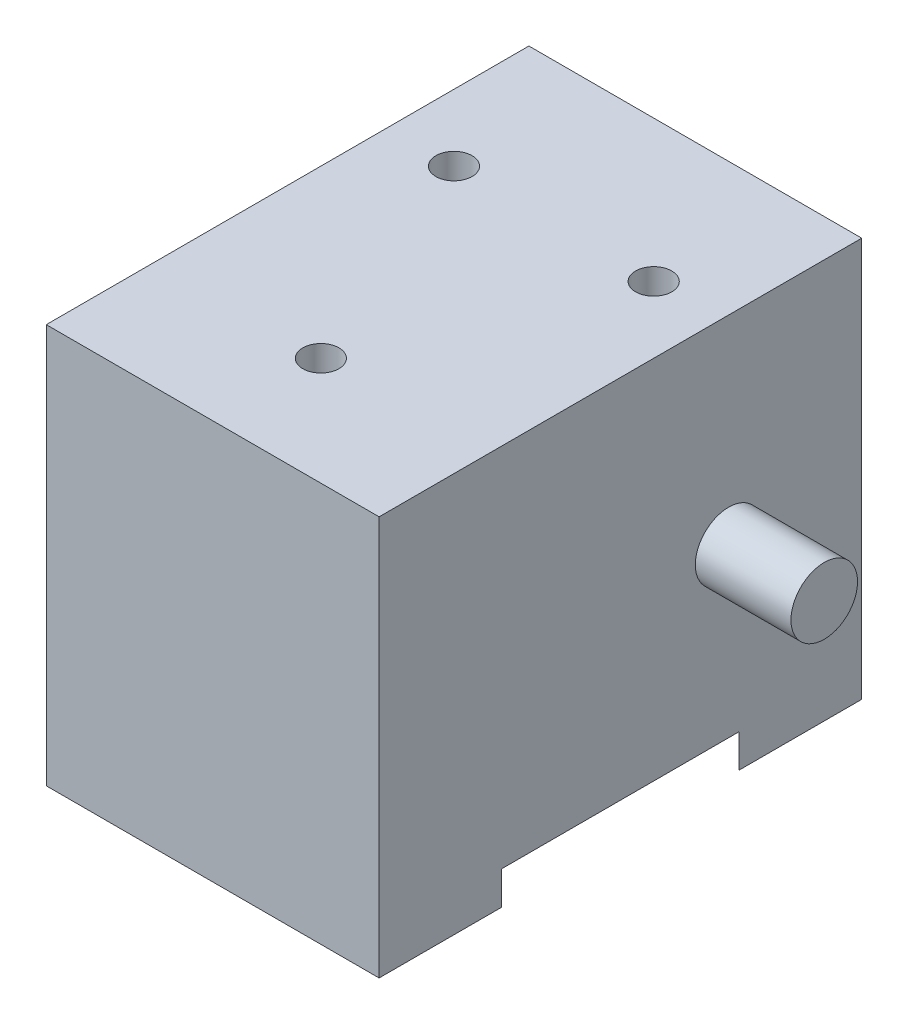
ISO-10303-21;
HEADER;
FILE_DESCRIPTION(('STEP AP214'),'2;1');
FILE_NAME('part.step','',(''),(''),'','','');
FILE_SCHEMA(('AUTOMOTIVE_DESIGN { 1 0 10303 214 1 1 1 1 }'));
ENDSEC;
DATA;
#1=APPLICATION_CONTEXT('core data for automotive mechanical design processes');
#2=APPLICATION_PROTOCOL_DEFINITION('international standard','automotive_design',2000,#1);
#3=PRODUCT_CONTEXT('',#1,'mechanical');
#4=PRODUCT('Part','Part','',(#3));
#5=PRODUCT_RELATED_PRODUCT_CATEGORY('part','',(#4));
#6=PRODUCT_DEFINITION_FORMATION('','',#4);
#7=PRODUCT_DEFINITION_CONTEXT('part definition',#1,'design');
#8=PRODUCT_DEFINITION('design','',#6,#7);
#9=PRODUCT_DEFINITION_SHAPE('','',#8);
#10=(LENGTH_UNIT() NAMED_UNIT(*) SI_UNIT(.MILLI.,.METRE.));
#11=(NAMED_UNIT(*) PLANE_ANGLE_UNIT() SI_UNIT($,.RADIAN.));
#12=(NAMED_UNIT(*) SI_UNIT($,.STERADIAN.) SOLID_ANGLE_UNIT());
#13=UNCERTAINTY_MEASURE_WITH_UNIT(LENGTH_MEASURE(1.E-05),#10,'distance_accuracy_value','');
#14=(GEOMETRIC_REPRESENTATION_CONTEXT(3) GLOBAL_UNCERTAINTY_ASSIGNED_CONTEXT((#13)) GLOBAL_UNIT_ASSIGNED_CONTEXT((#10,
#11,#12)) REPRESENTATION_CONTEXT('',''));
#15=CARTESIAN_POINT('',(0.,0.,0.));
#16=DIRECTION('',(0.,0.,1.));
#17=DIRECTION('',(1.,0.,0.));
#18=AXIS2_PLACEMENT_3D('',#15,#16,#17);
#19=CARTESIAN_POINT('',(15.875,38.1,-23.01875));
#20=DIRECTION('',(-1.,0.,0.));
#21=DIRECTION('',(0.,0.,1.));
#22=AXIS2_PLACEMENT_3D('',#19,#20,#21);
#23=PLANE('',#22);
#24=DIRECTION('',(0.,0.,-1.));
#25=VECTOR('',#24,1.);
#26=CARTESIAN_POINT('',(15.875,0.,-23.01875));
#27=LINE('',#26,#25);
#28=CARTESIAN_POINT('',(15.875,0.,23.01875));
#29=VERTEX_POINT('',#28);
#30=CARTESIAN_POINT('',(15.875,0.,11.3240617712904));
#31=VERTEX_POINT('',#30);
#32=EDGE_CURVE('E172',#29,#31,#27,.T.);
#33=ORIENTED_EDGE('',*,*,#32,.T.);
#34=DIRECTION('',(0.,-1.,0.));
#35=VECTOR('',#34,1.);
#36=CARTESIAN_POINT('',(15.875,3.175,11.3240617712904));
#37=LINE('',#36,#35);
#38=CARTESIAN_POINT('',(15.875,3.175,11.3240617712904));
#39=VERTEX_POINT('',#38);
#40=EDGE_CURVE('E146',#39,#31,#37,.T.);
#41=ORIENTED_EDGE('',*,*,#40,.F.);
#42=DIRECTION('',(0.,0.,1.));
#43=VECTOR('',#42,1.);
#44=CARTESIAN_POINT('',(15.875,3.175,11.3240617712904));
#45=LINE('',#44,#43);
#46=CARTESIAN_POINT('',(15.875,3.175,-11.3240617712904));
#47=VERTEX_POINT('',#46);
#48=EDGE_CURVE('E124',#47,#39,#45,.T.);
#49=ORIENTED_EDGE('',*,*,#48,.F.);
#50=DIRECTION('',(0.,-1.,0.));
#51=VECTOR('',#50,1.);
#52=CARTESIAN_POINT('',(15.875,3.175,-11.3240617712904));
#53=LINE('',#52,#51);
#54=CARTESIAN_POINT('',(15.875,0.,-11.3240617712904));
#55=VERTEX_POINT('',#54);
#56=EDGE_CURVE('E149',#47,#55,#53,.T.);
#57=ORIENTED_EDGE('',*,*,#56,.T.);
#58=CARTESIAN_POINT('',(15.875,0.,-23.01875));
#59=VERTEX_POINT('',#58);
#60=EDGE_CURVE('E164',#55,#59,#27,.T.);
#61=ORIENTED_EDGE('',*,*,#60,.T.);
#62=DIRECTION('',(0.,-1.,0.));
#63=VECTOR('',#62,1.);
#64=CARTESIAN_POINT('',(15.875,38.1,-23.01875));
#65=LINE('',#64,#63);
#66=CARTESIAN_POINT('',(15.875,38.1,-23.01875));
#67=VERTEX_POINT('',#66);
#68=EDGE_CURVE('E186',#67,#59,#65,.T.);
#69=ORIENTED_EDGE('',*,*,#68,.F.);
#70=DIRECTION('',(0.,0.,-1.));
#71=VECTOR('',#70,1.);
#72=CARTESIAN_POINT('',(15.875,38.1,-23.01875));
#73=LINE('',#72,#71);
#74=CARTESIAN_POINT('',(15.875,38.1,23.01875));
#75=VERTEX_POINT('',#74);
#76=EDGE_CURVE('E165',#75,#67,#73,.T.);
#77=ORIENTED_EDGE('',*,*,#76,.F.);
#78=DIRECTION('',(0.,-1.,0.));
#79=VECTOR('',#78,1.);
#80=CARTESIAN_POINT('',(15.875,38.1,23.01875));
#81=LINE('',#80,#79);
#82=EDGE_CURVE('E171',#75,#29,#81,.T.);
#83=ORIENTED_EDGE('',*,*,#82,.T.);
#84=EDGE_LOOP('',(#33,#41,#49,#57,#61,#69,#77,#83));
#85=FACE_BOUND('',#84,.T.);
#86=CARTESIAN_POINT('',(15.875,19.05,-10.31875));
#87=DIRECTION('',(-1.,0.,0.));
#88=DIRECTION('',(0.,0.,1.));
#89=AXIS2_PLACEMENT_3D('',#86,#87,#88);
#90=CIRCLE('',#89,3.175);
#91=CARTESIAN_POINT('',(15.875,19.05,-7.14375000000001));
#92=VERTEX_POINT('',#91);
#93=EDGE_CURVE('E11',#92,#92,#90,.F.);
#94=ORIENTED_EDGE('',*,*,#93,.F.);
#95=EDGE_LOOP('',(#94));
#96=FACE_BOUND('',#95,.T.);
#97=ADVANCED_FACE('F32',(#85,#96),#23,.F.);
#98=CARTESIAN_POINT('',(-15.875,38.1,-23.01875));
#99=DIRECTION('',(1.,0.,0.));
#100=DIRECTION('',(0.,0.,-1.));
#101=AXIS2_PLACEMENT_3D('',#98,#99,#100);
#102=PLANE('',#101);
#103=DIRECTION('',(0.,0.,-1.));
#104=VECTOR('',#103,1.);
#105=CARTESIAN_POINT('',(-15.875,3.175,11.3240617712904));
#106=LINE('',#105,#104);
#107=CARTESIAN_POINT('',(-15.875,3.175,11.3240617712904));
#108=VERTEX_POINT('',#107);
#109=CARTESIAN_POINT('',(-15.875,3.175,-11.3240617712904));
#110=VERTEX_POINT('',#109);
#111=EDGE_CURVE('E130',#108,#110,#106,.T.);
#112=ORIENTED_EDGE('',*,*,#111,.F.);
#113=DIRECTION('',(0.,-1.,0.));
#114=VECTOR('',#113,1.);
#115=CARTESIAN_POINT('',(-15.875,3.175,11.3240617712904));
#116=LINE('',#115,#114);
#117=CARTESIAN_POINT('',(-15.875,0.,11.3240617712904));
#118=VERTEX_POINT('',#117);
#119=EDGE_CURVE('E114',#108,#118,#116,.T.);
#120=ORIENTED_EDGE('',*,*,#119,.T.);
#121=DIRECTION('',(0.,0.,1.));
#122=VECTOR('',#121,1.);
#123=CARTESIAN_POINT('',(-15.875,0.,-23.01875));
#124=LINE('',#123,#122);
#125=CARTESIAN_POINT('',(-15.875,0.,23.01875));
#126=VERTEX_POINT('',#125);
#127=EDGE_CURVE('E177',#118,#126,#124,.T.);
#128=ORIENTED_EDGE('',*,*,#127,.T.);
#129=DIRECTION('',(0.,-1.,0.));
#130=VECTOR('',#129,1.);
#131=CARTESIAN_POINT('',(-15.875,38.1,23.01875));
#132=LINE('',#131,#130);
#133=CARTESIAN_POINT('',(-15.875,38.1,23.01875));
#134=VERTEX_POINT('',#133);
#135=EDGE_CURVE('E182',#134,#126,#132,.T.);
#136=ORIENTED_EDGE('',*,*,#135,.F.);
#137=DIRECTION('',(0.,0.,1.));
#138=VECTOR('',#137,1.);
#139=CARTESIAN_POINT('',(-15.875,38.1,-23.01875));
#140=LINE('',#139,#138);
#141=CARTESIAN_POINT('',(-15.875,38.1,-23.01875));
#142=VERTEX_POINT('',#141);
#143=EDGE_CURVE('E168',#142,#134,#140,.T.);
#144=ORIENTED_EDGE('',*,*,#143,.F.);
#145=DIRECTION('',(0.,-1.,0.));
#146=VECTOR('',#145,1.);
#147=CARTESIAN_POINT('',(-15.875,38.1,-23.01875));
#148=LINE('',#147,#146);
#149=CARTESIAN_POINT('',(-15.875,0.,-23.01875));
#150=VERTEX_POINT('',#149);
#151=EDGE_CURVE('E184',#142,#150,#148,.T.);
#152=ORIENTED_EDGE('',*,*,#151,.T.);
#153=CARTESIAN_POINT('',(-15.875,0.,-11.3240617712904));
#154=VERTEX_POINT('',#153);
#155=EDGE_CURVE('E178',#150,#154,#124,.T.);
#156=ORIENTED_EDGE('',*,*,#155,.T.);
#157=DIRECTION('',(0.,-1.,0.));
#158=VECTOR('',#157,1.);
#159=CARTESIAN_POINT('',(-15.875,3.175,-11.3240617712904));
#160=LINE('',#159,#158);
#161=EDGE_CURVE('E52',#110,#154,#160,.T.);
#162=ORIENTED_EDGE('',*,*,#161,.F.);
#163=EDGE_LOOP('',(#112,#120,#128,#136,#144,#152,#156,#162));
#164=FACE_BOUND('',#163,.T.);
#165=CARTESIAN_POINT('',(-15.875,19.05,-10.31875));
#166=DIRECTION('',(1.,0.,0.));
#167=DIRECTION('',(0.,0.,-1.));
#168=AXIS2_PLACEMENT_3D('',#165,#166,#167);
#169=CIRCLE('',#168,3.175);
#170=CARTESIAN_POINT('',(-15.875,19.05,-13.49375));
#171=VERTEX_POINT('',#170);
#172=EDGE_CURVE('E44',#171,#171,#169,.F.);
#173=ORIENTED_EDGE('',*,*,#172,.F.);
#174=EDGE_LOOP('',(#173));
#175=FACE_BOUND('',#174,.T.);
#176=ADVANCED_FACE('F135',(#164,#175),#102,.F.);
#177=CARTESIAN_POINT('',(9.525,38.1,-9.52373));
#178=DIRECTION('',(0.,1.,0.));
#179=DIRECTION('',(0.,0.,1.));
#180=AXIS2_PLACEMENT_3D('',#177,#178,#179);
#181=CYLINDRICAL_SURFACE('',#180,1.72719999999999);
#182=CARTESIAN_POINT('',(9.525,38.1,-9.52373));
#183=DIRECTION('',(0.,1.,0.));
#184=DIRECTION('',(0.,0.,1.));
#185=AXIS2_PLACEMENT_3D('',#182,#183,#184);
#186=CIRCLE('',#185,1.72719999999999);
#187=CARTESIAN_POINT('',(9.525,38.1,-7.79653000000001));
#188=VERTEX_POINT('',#187);
#189=EDGE_CURVE('E155',#188,#188,#186,.T.);
#190=ORIENTED_EDGE('',*,*,#189,.T.);
#191=EDGE_LOOP('',(#190));
#192=FACE_BOUND('',#191,.T.);
#193=CARTESIAN_POINT('',(9.525,20.9784790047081,-7.79653000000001));
#194=CARTESIAN_POINT('',(9.58924090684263,20.9784875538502,-7.7965342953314));
#195=CARTESIAN_POINT('',(9.65358439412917,20.9832461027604,-7.80015341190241));
#196=CARTESIAN_POINT('',(9.78028689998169,21.0015344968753,-7.81430173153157));
#197=CARTESIAN_POINT('',(9.8426397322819,21.015089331,-7.82485062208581));
#198=CARTESIAN_POINT('',(9.98220083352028,21.0542863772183,-7.85617948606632));
#199=CARTESIAN_POINT('',(10.0582428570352,21.0823368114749,-7.87908130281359));
#200=CARTESIAN_POINT('',(10.2037331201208,21.1460194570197,-7.93356900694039));
#201=CARTESIAN_POINT('',(10.2731650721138,21.1816697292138,-7.9651756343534));
#202=CARTESIAN_POINT('',(10.4355457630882,21.2744156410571,-8.0519833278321));
#203=CARTESIAN_POINT('',(10.5248763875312,21.3339038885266,-8.1113837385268));
#204=CARTESIAN_POINT('',(10.6902472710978,21.4553827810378,-8.2444004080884));
#205=CARTESIAN_POINT('',(10.7662716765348,21.5173763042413,-8.31803340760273));
#206=CARTESIAN_POINT('',(10.9057491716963,21.6407325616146,-8.48045121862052));
#207=CARTESIAN_POINT('',(10.9689163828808,21.7020570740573,-8.5695127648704));
#208=CARTESIAN_POINT('',(11.0784640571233,21.8187382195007,-8.76080133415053));
#209=CARTESIAN_POINT('',(11.1248786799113,21.8741068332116,-8.86300098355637));
#210=CARTESIAN_POINT('',(11.1891367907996,21.9632854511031,-9.05317385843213));
#211=CARTESIAN_POINT('',(11.2111398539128,21.999098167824,-9.13880270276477));
#212=CARTESIAN_POINT('',(11.2418676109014,22.0636193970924,-9.31500792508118));
#213=CARTESIAN_POINT('',(11.2506010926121,22.092332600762,-9.40558098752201));
#214=CARTESIAN_POINT('',(11.2534046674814,22.1416369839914,-9.58968963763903));
#215=CARTESIAN_POINT('',(11.2473987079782,22.1621853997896,-9.68323812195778));
#216=CARTESIAN_POINT('',(11.2198374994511,22.1944864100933,-9.86956935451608));
#217=CARTESIAN_POINT('',(11.198285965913,22.2062411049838,-9.96235228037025));
#218=CARTESIAN_POINT('',(11.1424565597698,22.2208170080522,-10.1358021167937));
#219=CARTESIAN_POINT('',(11.1094409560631,22.2243230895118,-10.2168227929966));
#220=CARTESIAN_POINT('',(11.0315311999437,22.2254976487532,-10.3729635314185));
#221=CARTESIAN_POINT('',(10.986636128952,22.2231656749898,-10.4480831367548));
#222=CARTESIAN_POINT('',(10.8852238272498,22.2140688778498,-10.5918599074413));
#223=CARTESIAN_POINT('',(10.8285004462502,22.207219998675,-10.6603657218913));
#224=CARTESIAN_POINT('',(10.7054180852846,22.1908307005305,-10.7877250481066));
#225=CARTESIAN_POINT('',(10.639055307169,22.1812892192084,-10.8465747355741));
#226=CARTESIAN_POINT('',(10.4927406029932,22.1606310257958,-10.9575229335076));
#227=CARTESIAN_POINT('',(10.4121351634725,22.1494495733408,-11.0087497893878));
#228=CARTESIAN_POINT('',(10.2434472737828,22.128402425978,-11.0973021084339));
#229=CARTESIAN_POINT('',(10.1553640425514,22.1185368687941,-11.1346261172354));
#230=CARTESIAN_POINT('',(9.97194280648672,22.1018696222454,-11.1949511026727));
#231=CARTESIAN_POINT('',(9.87648780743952,22.0951401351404,-11.2176188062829));
#232=CARTESIAN_POINT('',(9.68292050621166,22.0864761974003,-11.2464744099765));
#233=CARTESIAN_POINT('',(9.58480918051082,22.0845400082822,-11.2526682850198));
#234=CARTESIAN_POINT('',(9.39302192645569,22.0858359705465,-11.2484400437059));
#235=CARTESIAN_POINT('',(9.29932898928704,22.0888595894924,-11.238688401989));
#236=CARTESIAN_POINT('',(9.11498771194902,22.0990917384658,-11.204178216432));
#237=CARTESIAN_POINT('',(9.02433979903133,22.1063008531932,-11.1794175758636));
#238=CARTESIAN_POINT('',(8.84834020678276,22.1235482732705,-11.1156256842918));
#239=CARTESIAN_POINT('',(8.76299812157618,22.1335915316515,-11.0765694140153));
#240=CARTESIAN_POINT('',(8.59981371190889,22.1546113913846,-10.9852355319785));
#241=CARTESIAN_POINT('',(8.52197382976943,22.1655882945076,-10.9329536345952));
#242=CARTESIAN_POINT('',(8.3725985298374,22.1867486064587,-10.8139555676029));
#243=CARTESIAN_POINT('',(8.30146121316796,22.1968798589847,-10.7467285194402));
#244=CARTESIAN_POINT('',(8.17135867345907,22.2132818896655,-10.6009536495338));
#245=CARTESIAN_POINT('',(8.11239063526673,22.2195535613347,-10.5224084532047));
#246=CARTESIAN_POINT('',(8.00985958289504,22.2257837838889,-10.3584001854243));
#247=CARTESIAN_POINT('',(7.96593707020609,22.2259016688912,-10.2731690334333));
#248=CARTESIAN_POINT('',(7.89289662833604,22.2184650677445,-10.0969160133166));
#249=CARTESIAN_POINT('',(7.86376874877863,22.2109157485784,-10.0058980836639));
#250=CARTESIAN_POINT('',(7.82265165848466,22.1880975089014,-9.82849453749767));
#251=CARTESIAN_POINT('',(7.8095190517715,22.173465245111,-9.74228923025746));
#252=CARTESIAN_POINT('',(7.79628343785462,22.1368131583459,-9.57046847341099));
#253=CARTESIAN_POINT('',(7.79618098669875,22.1147930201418,-9.48485304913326));
#254=CARTESIAN_POINT('',(7.80817582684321,22.0640354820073,-9.31679727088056));
#255=CARTESIAN_POINT('',(7.82024348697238,22.0353145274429,-9.23434971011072));
#256=CARTESIAN_POINT('',(7.85532244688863,21.9721570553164,-9.07414202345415));
#257=CARTESIAN_POINT('',(7.87833683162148,21.9377189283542,-8.99638322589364));
#258=CARTESIAN_POINT('',(7.93733071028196,21.8599963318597,-8.83779043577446));
#259=CARTESIAN_POINT('',(7.97452593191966,21.81614693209,-8.75768913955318));
#260=CARTESIAN_POINT('',(8.05942877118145,21.7246435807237,-8.6056241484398));
#261=CARTESIAN_POINT('',(8.10714624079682,21.6769860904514,-8.53366817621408));
#262=CARTESIAN_POINT('',(8.22178997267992,21.5706274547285,-8.3856579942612));
#263=CARTESIAN_POINT('',(8.29064090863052,21.5115342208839,-8.31137556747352));
#264=CARTESIAN_POINT('',(8.44064139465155,21.3942003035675,-8.17553222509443));
#265=CARTESIAN_POINT('',(8.52179307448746,21.3359597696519,-8.11397351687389));
#266=CARTESIAN_POINT('',(8.67411316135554,21.2394762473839,-8.01871134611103));
#267=CARTESIAN_POINT('',(8.74252026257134,21.1999303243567,-7.98191109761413));
#268=CARTESIAN_POINT('',(8.88646302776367,21.1271168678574,-7.91696335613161));
#269=CARTESIAN_POINT('',(8.96198599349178,21.093838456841,-7.88880081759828));
#270=CARTESIAN_POINT('',(9.10030987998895,21.0446965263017,-7.84841254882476));
#271=CARTESIAN_POINT('',(9.16164235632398,21.0265616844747,-7.83396833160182));
#272=CARTESIAN_POINT('',(9.28724049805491,20.9983674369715,-7.81179536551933));
#273=CARTESIAN_POINT('',(9.35149572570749,20.9882813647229,-7.80404443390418));
#274=CARTESIAN_POINT('',(9.43434355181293,20.9814640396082,-7.79881492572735));
#275=CARTESIAN_POINT('',(9.45244263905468,20.980347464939,-7.79795949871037));
#276=CARTESIAN_POINT('',(9.48869174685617,20.9788536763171,-7.79681638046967));
#277=CARTESIAN_POINT('',(9.50684177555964,20.9784765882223,-7.79652878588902));
#278=CARTESIAN_POINT('',(9.525,20.9784790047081,-7.79653000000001));
#279=B_SPLINE_CURVE_WITH_KNOTS('',3,(#193,#194,#195,#196,#197,#198,#199,#200,#201,#202,#203,
#204,#205,#206,#207,#208,#209,#210,#211,#212,#213,#214,#215,#216,#217,#218,#219,#220,#221,#222,
#223,#224,#225,#226,#227,#228,#229,#230,#231,#232,#233,#234,#235,#236,#237,#238,#239,#240,#241,
#242,#243,#244,#245,#246,#247,#248,#249,#250,#251,#252,#253,#254,#255,#256,#257,#258,#259,#260,
#261,#262,#263,#264,#265,#266,#267,#268,#269,#270,#271,#272,#273,#274,#275,#276,#277,#278),
.UNSPECIFIED.,.T.,.F.,(4,2,2,2,2,2,2,2,2,2,2,2,2,2,2,2,2,2,2,2,2,2,2,2,2,2,2,2,2,2,2,2,2,2,2,2,
2,2,2,2,2,2,4),(0.,0.192644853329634,0.385839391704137,0.637087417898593,0.888939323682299,
1.2550280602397,1.62155004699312,1.99549725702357,2.36867759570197,2.65368097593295,
2.93849552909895,3.2247827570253,3.51100158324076,3.77245923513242,4.03393711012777,
4.3004236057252,4.56701538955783,4.8541834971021,5.14138163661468,5.43489996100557,
5.72831181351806,6.00970050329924,6.29112851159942,6.57305143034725,6.85506582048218,
7.14883690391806,7.44253995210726,7.72863455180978,8.01453647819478,8.27850484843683,
8.54248448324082,8.80582294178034,9.06923565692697,9.3639518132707,9.65894509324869,
10.0093847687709,10.3598851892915,10.6206723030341,10.8810025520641,11.0769972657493,
11.2723398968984,11.3267832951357,11.3812359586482),.UNSPECIFIED.);
#280=CARTESIAN_POINT('',(9.525,20.9784790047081,-7.79653000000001));
#281=VERTEX_POINT('',#280);
#282=EDGE_CURVE('E189',#281,#281,#279,.T.);
#283=ORIENTED_EDGE('',*,*,#282,.F.);
#284=EDGE_LOOP('',(#283));
#285=FACE_BOUND('',#284,.T.);
#286=ADVANCED_FACE('F204',(#192,#285),#181,.F.);
#287=CARTESIAN_POINT('',(-9.525,38.1,-9.52373));
#288=DIRECTION('',(0.,1.,0.));
#289=DIRECTION('',(0.,0.,1.));
#290=AXIS2_PLACEMENT_3D('',#287,#288,#289);
#291=CYLINDRICAL_SURFACE('',#290,1.72719999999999);
#292=CARTESIAN_POINT('',(-9.525,38.1,-9.52373));
#293=DIRECTION('',(0.,1.,0.));
#294=DIRECTION('',(0.,0.,1.));
#295=AXIS2_PLACEMENT_3D('',#292,#293,#294);
#296=CIRCLE('',#295,1.72719999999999);
#297=CARTESIAN_POINT('',(-9.525,38.1,-7.79653000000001));
#298=VERTEX_POINT('',#297);
#299=EDGE_CURVE('E148',#298,#298,#296,.T.);
#300=ORIENTED_EDGE('',*,*,#299,.T.);
#301=EDGE_LOOP('',(#300));
#302=FACE_BOUND('',#301,.T.);
#303=CARTESIAN_POINT('',(-9.525,20.9784790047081,-7.79653000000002));
#304=CARTESIAN_POINT('',(-9.46075909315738,20.9784875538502,-7.7965342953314));
#305=CARTESIAN_POINT('',(-9.39641560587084,20.9832461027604,-7.80015341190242));
#306=CARTESIAN_POINT('',(-9.26971310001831,21.0015344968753,-7.81430173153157));
#307=CARTESIAN_POINT('',(-9.2073602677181,21.015089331,-7.82485062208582));
#308=CARTESIAN_POINT('',(-9.06779916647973,21.0542863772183,-7.85617948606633));
#309=CARTESIAN_POINT('',(-8.99175714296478,21.0823368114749,-7.87908130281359));
#310=CARTESIAN_POINT('',(-8.84626687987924,21.1460194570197,-7.93356900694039));
#311=CARTESIAN_POINT('',(-8.77683492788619,21.1816697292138,-7.9651756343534));
#312=CARTESIAN_POINT('',(-8.61445423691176,21.2744156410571,-8.0519833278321));
#313=CARTESIAN_POINT('',(-8.52512361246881,21.3339038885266,-8.1113837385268));
#314=CARTESIAN_POINT('',(-8.35975272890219,21.4553827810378,-8.2444004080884));
#315=CARTESIAN_POINT('',(-8.28372832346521,21.5173763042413,-8.31803340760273));
#316=CARTESIAN_POINT('',(-8.14425082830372,21.6407325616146,-8.48045121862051));
#317=CARTESIAN_POINT('',(-8.08108361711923,21.7020570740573,-8.5695127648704));
#318=CARTESIAN_POINT('',(-7.97153594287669,21.8187382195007,-8.76080133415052));
#319=CARTESIAN_POINT('',(-7.9251213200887,21.8741068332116,-8.86300098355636));
#320=CARTESIAN_POINT('',(-7.86086320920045,21.9632854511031,-9.05317385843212));
#321=CARTESIAN_POINT('',(-7.83886014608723,21.999098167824,-9.13880270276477));
#322=CARTESIAN_POINT('',(-7.80813238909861,22.0636193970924,-9.31500792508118));
#323=CARTESIAN_POINT('',(-7.79939890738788,22.092332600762,-9.40558098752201));
#324=CARTESIAN_POINT('',(-7.79659533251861,22.1416369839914,-9.58968963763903));
#325=CARTESIAN_POINT('',(-7.8026012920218,22.1621853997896,-9.68323812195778));
#326=CARTESIAN_POINT('',(-7.83016250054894,22.1944864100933,-9.86956935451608));
#327=CARTESIAN_POINT('',(-7.85171403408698,22.2062411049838,-9.96235228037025));
#328=CARTESIAN_POINT('',(-7.90754344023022,22.2208170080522,-10.1358021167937));
#329=CARTESIAN_POINT('',(-7.94055904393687,22.2243230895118,-10.2168227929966));
#330=CARTESIAN_POINT('',(-8.01846880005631,22.2254976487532,-10.3729635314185));
#331=CARTESIAN_POINT('',(-8.06336387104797,22.2231656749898,-10.4480831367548));
#332=CARTESIAN_POINT('',(-8.16477617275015,22.2140688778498,-10.5918599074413));
#333=CARTESIAN_POINT('',(-8.22149955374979,22.207219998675,-10.6603657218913));
#334=CARTESIAN_POINT('',(-8.34458191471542,22.1908307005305,-10.7877250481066));
#335=CARTESIAN_POINT('',(-8.41094469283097,22.1812892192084,-10.8465747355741));
#336=CARTESIAN_POINT('',(-8.55725939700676,22.1606310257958,-10.9575229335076));
#337=CARTESIAN_POINT('',(-8.63786483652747,22.1494495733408,-11.0087497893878));
#338=CARTESIAN_POINT('',(-8.80655272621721,22.128402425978,-11.0973021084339));
#339=CARTESIAN_POINT('',(-8.89463595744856,22.1185368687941,-11.1346261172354));
#340=CARTESIAN_POINT('',(-9.07805719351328,22.1018696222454,-11.1949511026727));
#341=CARTESIAN_POINT('',(-9.17351219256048,22.0951401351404,-11.2176188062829));
#342=CARTESIAN_POINT('',(-9.36707949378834,22.0864761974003,-11.2464744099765));
#343=CARTESIAN_POINT('',(-9.46519081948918,22.0845400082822,-11.2526682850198));
#344=CARTESIAN_POINT('',(-9.65697807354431,22.0858359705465,-11.2484400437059));
#345=CARTESIAN_POINT('',(-9.75067101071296,22.0888595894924,-11.238688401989));
#346=CARTESIAN_POINT('',(-9.93501228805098,22.0990917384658,-11.204178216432));
#347=CARTESIAN_POINT('',(-10.0256602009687,22.1063008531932,-11.1794175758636));
#348=CARTESIAN_POINT('',(-10.2016597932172,22.1235482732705,-11.1156256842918));
#349=CARTESIAN_POINT('',(-10.2870018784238,22.1335915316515,-11.0765694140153));
#350=CARTESIAN_POINT('',(-10.4501862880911,22.1546113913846,-10.9852355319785));
#351=CARTESIAN_POINT('',(-10.5280261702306,22.1655882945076,-10.9329536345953));
#352=CARTESIAN_POINT('',(-10.6774014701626,22.1867486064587,-10.8139555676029));
#353=CARTESIAN_POINT('',(-10.748538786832,22.1968798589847,-10.7467285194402));
#354=CARTESIAN_POINT('',(-10.8786413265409,22.2132818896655,-10.6009536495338));
#355=CARTESIAN_POINT('',(-10.9376093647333,22.2195535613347,-10.5224084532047));
#356=CARTESIAN_POINT('',(-11.040140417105,22.2257837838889,-10.3584001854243));
#357=CARTESIAN_POINT('',(-11.0840629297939,22.2259016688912,-10.2731690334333));
#358=CARTESIAN_POINT('',(-11.157103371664,22.2184650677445,-10.0969160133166));
#359=CARTESIAN_POINT('',(-11.1862312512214,22.2109157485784,-10.0058980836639));
#360=CARTESIAN_POINT('',(-11.2273483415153,22.1880975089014,-9.82849453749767));
#361=CARTESIAN_POINT('',(-11.2404809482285,22.173465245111,-9.74228923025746));
#362=CARTESIAN_POINT('',(-11.2537165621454,22.1368131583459,-9.57046847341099));
#363=CARTESIAN_POINT('',(-11.2538190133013,22.1147930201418,-9.48485304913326));
#364=CARTESIAN_POINT('',(-11.2418241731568,22.0640354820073,-9.31679727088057));
#365=CARTESIAN_POINT('',(-11.2297565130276,22.0353145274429,-9.23434971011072));
#366=CARTESIAN_POINT('',(-11.1946775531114,21.9721570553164,-9.07414202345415));
#367=CARTESIAN_POINT('',(-11.1716631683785,21.9377189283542,-8.99638322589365));
#368=CARTESIAN_POINT('',(-11.112669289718,21.8599963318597,-8.83779043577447));
#369=CARTESIAN_POINT('',(-11.0754740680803,21.81614693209,-8.75768913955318));
#370=CARTESIAN_POINT('',(-10.9905712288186,21.7246435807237,-8.6056241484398));
#371=CARTESIAN_POINT('',(-10.9428537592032,21.6769860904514,-8.53366817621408));
#372=CARTESIAN_POINT('',(-10.8282100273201,21.5706274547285,-8.3856579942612));
#373=CARTESIAN_POINT('',(-10.7593590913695,21.5115342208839,-8.31137556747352));
#374=CARTESIAN_POINT('',(-10.6093586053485,21.3942003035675,-8.17553222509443));
#375=CARTESIAN_POINT('',(-10.5282069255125,21.3359597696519,-8.11397351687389));
#376=CARTESIAN_POINT('',(-10.3758868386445,21.239476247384,-8.01871134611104));
#377=CARTESIAN_POINT('',(-10.3074797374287,21.1999303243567,-7.98191109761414));
#378=CARTESIAN_POINT('',(-10.1635369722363,21.1271168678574,-7.91696335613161));
#379=CARTESIAN_POINT('',(-10.0880140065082,21.093838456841,-7.88880081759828));
#380=CARTESIAN_POINT('',(-9.94969012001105,21.0446965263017,-7.84841254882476));
#381=CARTESIAN_POINT('',(-9.88835764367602,21.0265616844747,-7.83396833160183));
#382=CARTESIAN_POINT('',(-9.7627595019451,20.9983674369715,-7.81179536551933));
#383=CARTESIAN_POINT('',(-9.69850427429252,20.9882813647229,-7.80404443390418));
#384=CARTESIAN_POINT('',(-9.61565644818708,20.9814640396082,-7.79881492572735));
#385=CARTESIAN_POINT('',(-9.59755736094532,20.980347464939,-7.79795949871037));
#386=CARTESIAN_POINT('',(-9.56130825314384,20.9788536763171,-7.79681638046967));
#387=CARTESIAN_POINT('',(-9.54315822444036,20.9784765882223,-7.79652878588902));
#388=CARTESIAN_POINT('',(-9.525,20.9784790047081,-7.79653000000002));
#389=B_SPLINE_CURVE_WITH_KNOTS('',3,(#303,#304,#305,#306,#307,#308,#309,#310,#311,#312,#313,
#314,#315,#316,#317,#318,#319,#320,#321,#322,#323,#324,#325,#326,#327,#328,#329,#330,#331,#332,
#333,#334,#335,#336,#337,#338,#339,#340,#341,#342,#343,#344,#345,#346,#347,#348,#349,#350,#351,
#352,#353,#354,#355,#356,#357,#358,#359,#360,#361,#362,#363,#364,#365,#366,#367,#368,#369,#370,
#371,#372,#373,#374,#375,#376,#377,#378,#379,#380,#381,#382,#383,#384,#385,#386,#387,#388),
.UNSPECIFIED.,.T.,.F.,(4,2,2,2,2,2,2,2,2,2,2,2,2,2,2,2,2,2,2,2,2,2,2,2,2,2,2,2,2,2,2,2,2,2,2,2,
2,2,2,2,2,2,4),(0.,0.192644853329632,0.385839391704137,0.637087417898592,0.888939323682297,
1.25502806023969,1.62155004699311,1.99549725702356,2.36867759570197,2.65368097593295,
2.93849552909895,3.2247827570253,3.51100158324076,3.77245923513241,4.03393711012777,
4.3004236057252,4.56701538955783,4.8541834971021,5.14138163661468,5.43489996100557,
5.72831181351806,6.00970050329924,6.29112851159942,6.57305143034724,6.85506582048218,
7.14883690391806,7.44253995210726,7.72863455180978,8.01453647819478,8.27850484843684,
8.54248448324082,8.80582294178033,9.06923565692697,9.3639518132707,9.65894509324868,
10.0093847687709,10.3598851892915,10.6206723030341,10.8810025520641,11.0769972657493,
11.2723398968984,11.3267832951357,11.3812359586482),.UNSPECIFIED.);
#390=CARTESIAN_POINT('',(-9.525,20.9784790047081,-7.79653000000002));
#391=VERTEX_POINT('',#390);
#392=EDGE_CURVE('E35',#391,#391,#389,.T.);
#393=ORIENTED_EDGE('',*,*,#392,.F.);
#394=EDGE_LOOP('',(#393));
#395=FACE_BOUND('',#394,.T.);
#396=ADVANCED_FACE('F226',(#302,#395),#291,.F.);
#397=CARTESIAN_POINT('',(15.875,0.,23.01875));
#398=DIRECTION('',(0.,1.,0.));
#399=DIRECTION('',(0.,0.,1.));
#400=AXIS2_PLACEMENT_3D('',#397,#398,#399);
#401=PLANE('',#400);
#402=ORIENTED_EDGE('',*,*,#127,.F.);
#403=CARTESIAN_POINT('',(0.,0.,0.));
#404=DIRECTION('',(0.,-1.,0.));
#405=DIRECTION('',(0.,0.,-1.));
#406=AXIS2_PLACEMENT_3D('',#403,#404,#405);
#407=CIRCLE('',#406,19.5);
#408=EDGE_CURVE('E120',#31,#118,#407,.T.);
#409=ORIENTED_EDGE('',*,*,#408,.F.);
#410=ORIENTED_EDGE('',*,*,#32,.F.);
#411=DIRECTION('',(1.,0.,0.));
#412=VECTOR('',#411,1.);
#413=CARTESIAN_POINT('',(-15.875,0.,23.01875));
#414=LINE('',#413,#412);
#415=EDGE_CURVE('E82',#126,#29,#414,.T.);
#416=ORIENTED_EDGE('',*,*,#415,.F.);
#417=EDGE_LOOP('',(#402,#409,#410,#416));
#418=FACE_BOUND('',#417,.T.);
#419=ADVANCED_FACE('F229',(#418),#401,.F.);
#420=CARTESIAN_POINT('',(-15.875,38.1,-23.01875));
#421=DIRECTION('',(0.,0.,1.));
#422=DIRECTION('',(1.,0.,0.));
#423=AXIS2_PLACEMENT_3D('',#420,#421,#422);
#424=PLANE('',#423);
#425=DIRECTION('',(-1.,0.,0.));
#426=VECTOR('',#425,1.);
#427=CARTESIAN_POINT('',(-15.875,0.,-23.01875));
#428=LINE('',#427,#426);
#429=EDGE_CURVE('E175',#59,#150,#428,.T.);
#430=ORIENTED_EDGE('',*,*,#429,.T.);
#431=ORIENTED_EDGE('',*,*,#151,.F.);
#432=DIRECTION('',(-1.,0.,0.));
#433=VECTOR('',#432,1.);
#434=CARTESIAN_POINT('',(-15.875,38.1,-23.01875));
#435=LINE('',#434,#433);
#436=EDGE_CURVE('E90',#67,#142,#435,.T.);
#437=ORIENTED_EDGE('',*,*,#436,.F.);
#438=ORIENTED_EDGE('',*,*,#68,.T.);
#439=EDGE_LOOP('',(#430,#431,#437,#438));
#440=FACE_BOUND('',#439,.T.);
#441=ADVANCED_FACE('F235',(#440),#424,.F.);
#442=CARTESIAN_POINT('',(-15.875,38.1,23.01875));
#443=DIRECTION('',(0.,0.,-1.));
#444=DIRECTION('',(-1.,0.,0.));
#445=AXIS2_PLACEMENT_3D('',#442,#443,#444);
#446=PLANE('',#445);
#447=ORIENTED_EDGE('',*,*,#415,.T.);
#448=ORIENTED_EDGE('',*,*,#82,.F.);
#449=DIRECTION('',(1.,0.,0.));
#450=VECTOR('',#449,1.);
#451=CARTESIAN_POINT('',(-15.875,38.1,23.01875));
#452=LINE('',#451,#450);
#453=EDGE_CURVE('E61',#134,#75,#452,.T.);
#454=ORIENTED_EDGE('',*,*,#453,.F.);
#455=ORIENTED_EDGE('',*,*,#135,.T.);
#456=EDGE_LOOP('',(#447,#448,#454,#455));
#457=FACE_BOUND('',#456,.T.);
#458=ADVANCED_FACE('F254',(#457),#446,.F.);
#459=CARTESIAN_POINT('',(15.875,38.1,23.01875));
#460=DIRECTION('',(0.,1.,0.));
#461=DIRECTION('',(0.,0.,1.));
#462=AXIS2_PLACEMENT_3D('',#459,#460,#461);
#463=PLANE('',#462);
#464=ORIENTED_EDGE('',*,*,#299,.F.);
#465=EDGE_LOOP('',(#464));
#466=FACE_BOUND('',#465,.T.);
#467=ORIENTED_EDGE('',*,*,#189,.F.);
#468=EDGE_LOOP('',(#467));
#469=FACE_BOUND('',#468,.T.);
#470=CARTESIAN_POINT('',(0.,38.1,12.70127));
#471=DIRECTION('',(0.,1.,0.));
#472=DIRECTION('',(0.,0.,1.));
#473=AXIS2_PLACEMENT_3D('',#470,#471,#472);
#474=CIRCLE('',#473,1.72719999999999);
#475=CARTESIAN_POINT('',(0.,38.1,14.42847));
#476=VERTEX_POINT('',#475);
#477=EDGE_CURVE('E158',#476,#476,#474,.T.);
#478=ORIENTED_EDGE('',*,*,#477,.F.);
#479=EDGE_LOOP('',(#478));
#480=FACE_BOUND('',#479,.T.);
#481=ORIENTED_EDGE('',*,*,#76,.T.);
#482=ORIENTED_EDGE('',*,*,#436,.T.);
#483=ORIENTED_EDGE('',*,*,#143,.T.);
#484=ORIENTED_EDGE('',*,*,#453,.T.);
#485=EDGE_LOOP('',(#481,#482,#483,#484));
#486=FACE_BOUND('',#485,.T.);
#487=ADVANCED_FACE('F255',(#466,#469,#480,#486),#463,.T.);
#488=ORIENTED_EDGE('',*,*,#60,.F.);
#489=CARTESIAN_POINT('',(0.,0.,0.));
#490=DIRECTION('',(0.,-1.,0.));
#491=DIRECTION('',(0.,0.,-1.));
#492=AXIS2_PLACEMENT_3D('',#489,#490,#491);
#493=CIRCLE('',#492,19.5);
#494=EDGE_CURVE('E133',#154,#55,#493,.T.);
#495=ORIENTED_EDGE('',*,*,#494,.F.);
#496=ORIENTED_EDGE('',*,*,#155,.F.);
#497=ORIENTED_EDGE('',*,*,#429,.F.);
#498=EDGE_LOOP('',(#488,#495,#496,#497));
#499=FACE_BOUND('',#498,.T.);
#500=ADVANCED_FACE('F238',(#499),#401,.F.);
#501=CARTESIAN_POINT('',(0.,19.05,12.70127));
#502=DIRECTION('',(0.,1.,0.));
#503=DIRECTION('',(0.,0.,1.));
#504=AXIS2_PLACEMENT_3D('',#501,#502,#503);
#505=CONICAL_SURFACE('',#504,1.72719999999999,1.02974425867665);
#506=CARTESIAN_POINT('',(0.,18.0121935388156,12.70127));
#507=VERTEX_POINT('',#506);
#508=VERTEX_LOOP('',#507);
#509=FACE_BOUND('',#508,.T.);
#510=CARTESIAN_POINT('',(0.,19.05,12.70127));
#511=DIRECTION('',(0.,1.,0.));
#512=DIRECTION('',(0.,0.,1.));
#513=AXIS2_PLACEMENT_3D('',#510,#511,#512);
#514=CIRCLE('',#513,1.72719999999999);
#515=CARTESIAN_POINT('',(0.,19.05,14.42847));
#516=VERTEX_POINT('',#515);
#517=EDGE_CURVE('E161',#516,#516,#514,.T.);
#518=ORIENTED_EDGE('',*,*,#517,.T.);
#519=EDGE_LOOP('',(#518));
#520=FACE_BOUND('',#519,.T.);
#521=ADVANCED_FACE('F261',(#509,#520),#505,.F.);
#522=CARTESIAN_POINT('',(0.,38.1,12.70127));
#523=DIRECTION('',(0.,1.,0.));
#524=DIRECTION('',(0.,0.,1.));
#525=AXIS2_PLACEMENT_3D('',#522,#523,#524);
#526=CYLINDRICAL_SURFACE('',#525,1.72719999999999);
#527=ORIENTED_EDGE('',*,*,#517,.F.);
#528=EDGE_LOOP('',(#527));
#529=FACE_BOUND('',#528,.T.);
#530=ORIENTED_EDGE('',*,*,#477,.T.);
#531=EDGE_LOOP('',(#530));
#532=FACE_BOUND('',#531,.T.);
#533=ADVANCED_FACE('F225',(#529,#532),#526,.F.);
#534=CARTESIAN_POINT('',(0.,3.175,0.));
#535=DIRECTION('',(0.,-1.,0.));
#536=DIRECTION('',(0.,0.,-1.));
#537=AXIS2_PLACEMENT_3D('',#534,#535,#536);
#538=CYLINDRICAL_SURFACE('',#537,19.5);
#539=ORIENTED_EDGE('',*,*,#408,.T.);
#540=ORIENTED_EDGE('',*,*,#119,.F.);
#541=CARTESIAN_POINT('',(0.,3.175,0.));
#542=DIRECTION('',(0.,-1.,0.));
#543=DIRECTION('',(0.,0.,-1.));
#544=AXIS2_PLACEMENT_3D('',#541,#542,#543);
#545=CIRCLE('',#544,19.5);
#546=EDGE_CURVE('E117',#39,#108,#545,.T.);
#547=ORIENTED_EDGE('',*,*,#546,.F.);
#548=ORIENTED_EDGE('',*,*,#40,.T.);
#549=EDGE_LOOP('',(#539,#540,#547,#548));
#550=FACE_BOUND('',#549,.T.);
#551=ADVANCED_FACE('F116',(#550),#538,.F.);
#552=CARTESIAN_POINT('',(0.,3.175,0.));
#553=DIRECTION('',(0.,-1.,0.));
#554=DIRECTION('',(0.,0.,-1.));
#555=AXIS2_PLACEMENT_3D('',#552,#553,#554);
#556=CYLINDRICAL_SURFACE('',#555,19.5);
#557=ORIENTED_EDGE('',*,*,#494,.T.);
#558=ORIENTED_EDGE('',*,*,#56,.F.);
#559=CARTESIAN_POINT('',(0.,3.175,0.));
#560=DIRECTION('',(0.,-1.,0.));
#561=DIRECTION('',(0.,0.,-1.));
#562=AXIS2_PLACEMENT_3D('',#559,#560,#561);
#563=CIRCLE('',#562,19.5);
#564=EDGE_CURVE('E138',#110,#47,#563,.T.);
#565=ORIENTED_EDGE('',*,*,#564,.F.);
#566=ORIENTED_EDGE('',*,*,#161,.T.);
#567=EDGE_LOOP('',(#557,#558,#565,#566));
#568=FACE_BOUND('',#567,.T.);
#569=ADVANCED_FACE('F221',(#568),#556,.F.);
#570=CARTESIAN_POINT('',(0.,3.175,0.));
#571=DIRECTION('',(0.,-1.,0.));
#572=DIRECTION('',(0.,0.,-1.));
#573=AXIS2_PLACEMENT_3D('',#570,#571,#572);
#574=PLANE('',#573);
#575=ORIENTED_EDGE('',*,*,#546,.T.);
#576=ORIENTED_EDGE('',*,*,#111,.T.);
#577=ORIENTED_EDGE('',*,*,#564,.T.);
#578=ORIENTED_EDGE('',*,*,#48,.T.);
#579=EDGE_LOOP('',(#575,#576,#577,#578));
#580=FACE_BOUND('',#579,.T.);
#581=ADVANCED_FACE('F128',(#580),#574,.T.);
#582=CARTESIAN_POINT('',(25.,19.05,-10.31875));
#583=DIRECTION('',(-1.,0.,0.));
#584=DIRECTION('',(0.,0.,1.));
#585=AXIS2_PLACEMENT_3D('',#582,#583,#584);
#586=CYLINDRICAL_SURFACE('',#585,3.175);
#587=ORIENTED_EDGE('',*,*,#392,.T.);
#588=EDGE_LOOP('',(#587));
#589=FACE_BOUND('',#588,.T.);
#590=ADVANCED_FACE('F215',(#589),#586,.T.);
#591=ORIENTED_EDGE('',*,*,#282,.T.);
#592=EDGE_LOOP('',(#591));
#593=FACE_BOUND('',#592,.T.);
#594=ADVANCED_FACE('F354',(#593),#586,.T.);
#595=CARTESIAN_POINT('',(-25.,19.05,-10.31875));
#596=DIRECTION('',(1.,0.,0.));
#597=DIRECTION('',(0.,0.,-1.));
#598=AXIS2_PLACEMENT_3D('',#595,#596,#597);
#599=PLANE('',#598);
#600=CARTESIAN_POINT('',(-25.,19.05,-10.31875));
#601=DIRECTION('',(1.,0.,0.));
#602=DIRECTION('',(0.,0.,-1.));
#603=AXIS2_PLACEMENT_3D('',#600,#601,#602);
#604=CIRCLE('',#603,3.175);
#605=CARTESIAN_POINT('',(-25.,19.05,-13.49375));
#606=VERTEX_POINT('',#605);
#607=EDGE_CURVE('E202',#606,#606,#604,.T.);
#608=ORIENTED_EDGE('',*,*,#607,.F.);
#609=EDGE_LOOP('',(#608));
#610=FACE_BOUND('',#609,.T.);
#611=ADVANCED_FACE('F216',(#610),#599,.F.);
#612=ORIENTED_EDGE('',*,*,#607,.T.);
#613=EDGE_LOOP('',(#612));
#614=FACE_BOUND('',#613,.T.);
#615=ORIENTED_EDGE('',*,*,#172,.T.);
#616=EDGE_LOOP('',(#615));
#617=FACE_BOUND('',#616,.T.);
#618=ADVANCED_FACE('F213',(#614,#617),#586,.T.);
#619=CARTESIAN_POINT('',(25.,19.05,-10.31875));
#620=DIRECTION('',(1.,0.,0.));
#621=DIRECTION('',(0.,0.,-1.));
#622=AXIS2_PLACEMENT_3D('',#619,#620,#621);
#623=CIRCLE('',#622,3.175);
#624=CARTESIAN_POINT('',(25.,19.05,-13.49375));
#625=VERTEX_POINT('',#624);
#626=EDGE_CURVE('E144',#625,#625,#623,.T.);
#627=ORIENTED_EDGE('',*,*,#626,.F.);
#628=EDGE_LOOP('',(#627));
#629=FACE_BOUND('',#628,.T.);
#630=ORIENTED_EDGE('',*,*,#93,.T.);
#631=EDGE_LOOP('',(#630));
#632=FACE_BOUND('',#631,.T.);
#633=ADVANCED_FACE('F207',(#629,#632),#586,.T.);
#634=CARTESIAN_POINT('',(25.,19.05,-10.31875));
#635=DIRECTION('',(1.,0.,0.));
#636=DIRECTION('',(0.,0.,-1.));
#637=AXIS2_PLACEMENT_3D('',#634,#635,#636);
#638=PLANE('',#637);
#639=ORIENTED_EDGE('',*,*,#626,.T.);
#640=EDGE_LOOP('',(#639));
#641=FACE_BOUND('',#640,.T.);
#642=ADVANCED_FACE('F212',(#641),#638,.T.);
#643=CLOSED_SHELL('',(#97,#176,#286,#396,#419,#441,#458,#487,#500,#521,#533,#551,#569,#581,#590,
#594,#611,#618,#633,#642));
#644=MANIFOLD_SOLID_BREP('B2',#643);
#645=ADVANCED_BREP_SHAPE_REPRESENTATION('',(#18,#644),#14);
#646=SHAPE_DEFINITION_REPRESENTATION(#9,#645);
ENDSEC;
END-ISO-10303-21;
